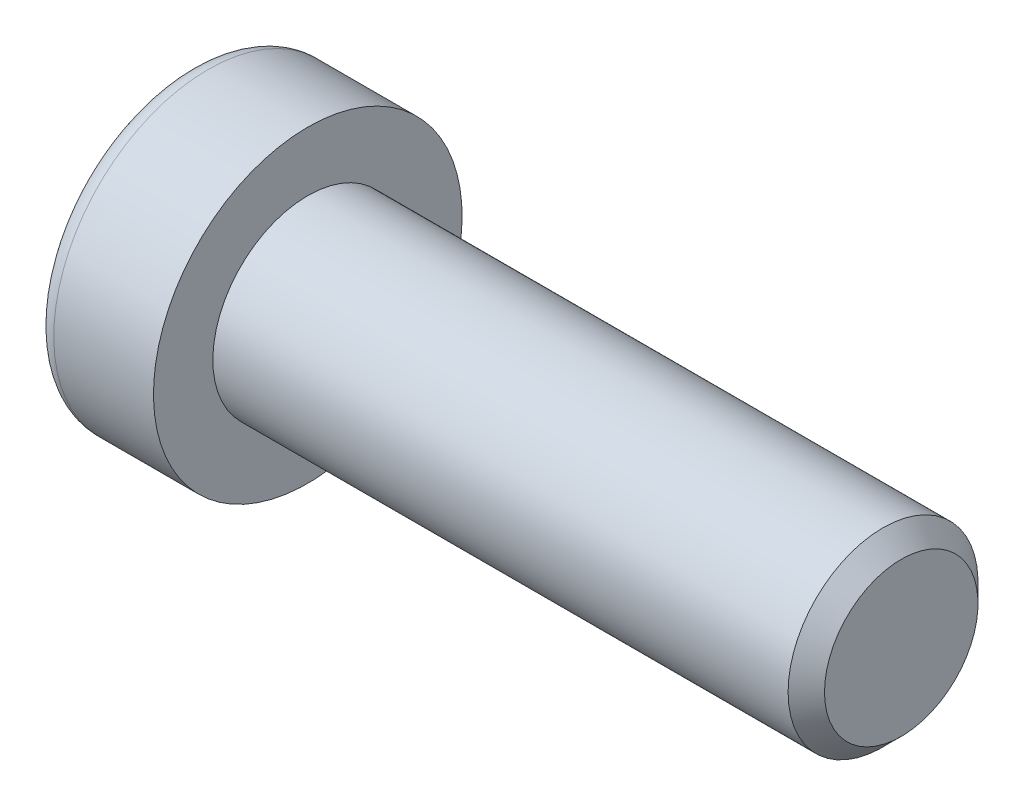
ISO-10303-21;
HEADER;
FILE_DESCRIPTION(('STEP AP214'),'2;1');
FILE_NAME('part.step','',(''),(''),'','','');
FILE_SCHEMA(('AUTOMOTIVE_DESIGN { 1 0 10303 214 1 1 1 1 }'));
ENDSEC;
DATA;
#1=APPLICATION_CONTEXT('core data for automotive mechanical design processes');
#2=APPLICATION_PROTOCOL_DEFINITION('international standard','automotive_design',2000,#1);
#3=PRODUCT_CONTEXT('',#1,'mechanical');
#4=PRODUCT('Part','Part','',(#3));
#5=PRODUCT_RELATED_PRODUCT_CATEGORY('part','',(#4));
#6=PRODUCT_DEFINITION_FORMATION('','',#4);
#7=PRODUCT_DEFINITION_CONTEXT('part definition',#1,'design');
#8=PRODUCT_DEFINITION('design','',#6,#7);
#9=PRODUCT_DEFINITION_SHAPE('','',#8);
#10=(LENGTH_UNIT() NAMED_UNIT(*) SI_UNIT(.MILLI.,.METRE.));
#11=(NAMED_UNIT(*) PLANE_ANGLE_UNIT() SI_UNIT($,.RADIAN.));
#12=(NAMED_UNIT(*) SI_UNIT($,.STERADIAN.) SOLID_ANGLE_UNIT());
#13=UNCERTAINTY_MEASURE_WITH_UNIT(LENGTH_MEASURE(1.E-05),#10,'distance_accuracy_value','');
#14=(GEOMETRIC_REPRESENTATION_CONTEXT(3) GLOBAL_UNCERTAINTY_ASSIGNED_CONTEXT((#13)) GLOBAL_UNIT_ASSIGNED_CONTEXT((#10,
#11,#12)) REPRESENTATION_CONTEXT('',''));
#15=CARTESIAN_POINT('',(0.,0.,0.));
#16=DIRECTION('',(0.,0.,1.));
#17=DIRECTION('',(1.,0.,0.));
#18=AXIS2_PLACEMENT_3D('',#15,#16,#17);
#19=CARTESIAN_POINT('',(-1.21000000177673,0.,0.));
#20=DIRECTION('',(-1.,0.,0.));
#21=DIRECTION('',(0.,0.,1.));
#22=AXIS2_PLACEMENT_3D('',#19,#20,#21);
#23=CONICAL_SURFACE('',#22,2.9040718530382,1.04719754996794);
#24=CARTESIAN_POINT('',(0.466666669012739,-1.13686837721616E-10,0.));
#25=VERTEX_POINT('',#24);
#26=VERTEX_LOOP('',#25);
#27=FACE_BOUND('',#26,.T.);
#28=CARTESIAN_POINT('',(-1.20000000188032,2.50000000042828,1.44337567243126));
#29=CARTESIAN_POINT('',(-1.16336943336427,2.50000000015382,1.31652043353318));
#30=CARTESIAN_POINT('',(-1.13005584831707,2.50000000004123,1.18857018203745));
#31=CARTESIAN_POINT('',(-1.07190798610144,2.49999999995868,0.930454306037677));
#32=CARTESIAN_POINT('',(-1.04709427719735,2.49999999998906,0.800284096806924));
#33=CARTESIAN_POINT('',(-1.00846995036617,2.50000000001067,0.541556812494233));
#34=CARTESIAN_POINT('',(-0.994402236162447,2.50000000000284,0.413039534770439));
#35=CARTESIAN_POINT('',(-0.977611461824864,2.49999999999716,0.155400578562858));
#36=CARTESIAN_POINT('',(-0.974874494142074,2.49999999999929,0.0262798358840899));
#37=CARTESIAN_POINT('',(-0.980582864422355,2.50000000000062,-0.21496841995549));
#38=CARTESIAN_POINT('',(-0.987626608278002,2.50000000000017,-0.327132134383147));
#39=CARTESIAN_POINT('',(-1.00994662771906,2.49999999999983,-0.550728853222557));
#40=CARTESIAN_POINT('',(-1.02523052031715,2.49999999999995,-0.66216108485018));
#41=CARTESIAN_POINT('',(-1.06343729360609,2.50000000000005,-0.886218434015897));
#42=CARTESIAN_POINT('',(-1.08652205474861,2.50000000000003,-0.998815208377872));
#43=CARTESIAN_POINT('',(-1.13891470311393,2.49999999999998,-1.2223298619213));
#44=CARTESIAN_POINT('',(-1.16821028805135,2.49999999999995,-1.33325060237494));
#45=CARTESIAN_POINT('',(-1.20000000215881,2.5,-1.44337567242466));
#46=B_SPLINE_CURVE_WITH_KNOTS('',3,(#28,#29,#30,#31,#32,#33,#34,#35,#36,#37,#38,#39,#40,#41,#42,
#43,#44,#45),.UNSPECIFIED.,.F.,.F.,(4,2,2,2,2,2,2,2,4),(0.,0.396270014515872,0.793492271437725,
1.18088450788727,1.56780111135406,1.90463472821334,2.24178024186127,2.58640202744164,
2.93034746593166),.UNSPECIFIED.);
#47=CARTESIAN_POINT('',(-1.20000000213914,2.49999999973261,1.44337567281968));
#48=VERTEX_POINT('',#47);
#49=CARTESIAN_POINT('',(-1.20000000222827,2.5,-1.44337567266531));
#50=VERTEX_POINT('',#49);
#51=EDGE_CURVE('E20',#48,#50,#46,.T.);
#52=ORIENTED_EDGE('',*,*,#51,.T.);
#53=CARTESIAN_POINT('',(-1.20000000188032,2.49999999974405,-1.44337567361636));
#54=CARTESIAN_POINT('',(-1.16336943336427,2.39014014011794,-1.50680329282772));
#55=CARTESIAN_POINT('',(-1.13005584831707,2.27933197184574,-1.57077841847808));
#56=CARTESIAN_POINT('',(-1.07190798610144,2.05579706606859,-1.69983635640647));
#57=CARTESIAN_POINT('',(-1.04709427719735,1.94306635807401,-1.76492146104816));
#58=CARTESIAN_POINT('',(-1.00846995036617,1.71900195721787,-1.89428510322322));
#59=CARTESIAN_POINT('',(-0.994402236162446,1.60770272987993,-1.95854374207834));
#60=CARTESIAN_POINT('',(-0.977611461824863,1.38458084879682,-2.08736322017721));
#61=CARTESIAN_POINT('',(-0.974874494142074,1.27275900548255,-2.15192359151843));
#62=CARTESIAN_POINT('',(-0.980582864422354,1.06383188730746,-2.27254771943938));
#63=CARTESIAN_POINT('',(-0.987626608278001,0.966695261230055,-2.32862957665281));
#64=CARTESIAN_POINT('',(-1.00994662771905,0.773054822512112,-2.44042793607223));
#65=CARTESIAN_POINT('',(-1.02523052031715,0.676551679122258,-2.49614405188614));
#66=CARTESIAN_POINT('',(-1.06343729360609,0.482512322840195,-2.60817272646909));
#67=CARTESIAN_POINT('',(-1.08652205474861,0.385000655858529,-2.66447111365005));
#68=CARTESIAN_POINT('',(-1.13891470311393,0.191431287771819,-2.77622844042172));
#69=CARTESIAN_POINT('',(-1.16821028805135,0.09537110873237,-2.83168881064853));
#70=CARTESIAN_POINT('',(-1.20000000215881,4.75795613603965E-10,-2.88675134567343));
#71=B_SPLINE_CURVE_WITH_KNOTS('',3,(#53,#54,#55,#56,#57,#58,#59,#60,#61,#62,#63,#64,#65,#66,#67,
#68,#69,#70),.UNSPECIFIED.,.F.,.F.,(4,2,2,2,2,2,2,2,4),(0.,0.396270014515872,0.793492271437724,
1.18088450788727,1.56780111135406,1.90463472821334,2.24178024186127,2.58640202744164,
2.93034746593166),.UNSPECIFIED.);
#72=CARTESIAN_POINT('',(-1.20000000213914,0.,-2.88675134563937));
#73=VERTEX_POINT('',#72);
#74=EDGE_CURVE('E80',#50,#73,#71,.T.);
#75=ORIENTED_EDGE('',*,*,#74,.T.);
#76=CARTESIAN_POINT('',(-1.20000000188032,-6.84219602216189E-10,-2.88675134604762));
#77=CARTESIAN_POINT('',(-1.16336943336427,-0.109859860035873,-2.8233237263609));
#78=CARTESIAN_POINT('',(-1.13005584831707,-0.220668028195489,-2.75934860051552));
#79=CARTESIAN_POINT('',(-1.07190798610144,-0.444202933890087,-2.63029066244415));
#80=CARTESIAN_POINT('',(-1.04709427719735,-0.556933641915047,-2.56520555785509));
#81=CARTESIAN_POINT('',(-1.00846995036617,-0.780998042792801,-2.43584191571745));
#82=CARTESIAN_POINT('',(-0.994402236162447,-0.892297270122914,-2.37158327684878));
#83=CARTESIAN_POINT('',(-0.977611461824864,-1.11541915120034,-2.24276379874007));
#84=CARTESIAN_POINT('',(-0.974874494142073,-1.22724099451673,-2.17820342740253));
#85=CARTESIAN_POINT('',(-0.980582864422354,-1.43616811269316,-2.05757929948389));
#86=CARTESIAN_POINT('',(-0.987626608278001,-1.53330473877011,-2.00149744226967));
#87=CARTESIAN_POINT('',(-1.00994662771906,-1.72694517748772,-1.88969908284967));
#88=CARTESIAN_POINT('',(-1.02523052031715,-1.82344832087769,-1.83398296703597));
#89=CARTESIAN_POINT('',(-1.06343729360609,-2.01748767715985,-1.72195429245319));
#90=CARTESIAN_POINT('',(-1.08652205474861,-2.1149993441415,-1.66565590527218));
#91=CARTESIAN_POINT('',(-1.13891470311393,-2.30856871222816,-1.55389857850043));
#92=CARTESIAN_POINT('',(-1.16821028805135,-2.40462889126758,-1.49843820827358));
#93=CARTESIAN_POINT('',(-1.20000000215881,-2.49999999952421,-1.44337567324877));
#94=B_SPLINE_CURVE_WITH_KNOTS('',3,(#76,#77,#78,#79,#80,#81,#82,#83,#84,#85,#86,#87,#88,#89,#90,
#91,#92,#93),.UNSPECIFIED.,.F.,.F.,(4,2,2,2,2,2,2,2,4),(0.,0.396270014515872,0.793492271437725,
1.18088450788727,1.56780111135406,1.90463472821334,2.24178024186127,2.58640202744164,
2.93034746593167),.UNSPECIFIED.);
#95=CARTESIAN_POINT('',(-1.20000000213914,-2.49999999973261,-1.44337567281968));
#96=VERTEX_POINT('',#95);
#97=EDGE_CURVE('E105',#73,#96,#94,.T.);
#98=ORIENTED_EDGE('',*,*,#97,.T.);
#99=CARTESIAN_POINT('',(-1.20000000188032,-2.50000000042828,-1.44337567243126));
#100=CARTESIAN_POINT('',(-1.16336943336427,-2.50000000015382,-1.31652043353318));
#101=CARTESIAN_POINT('',(-1.13005584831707,-2.50000000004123,-1.18857018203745));
#102=CARTESIAN_POINT('',(-1.07190798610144,-2.49999999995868,-0.93045430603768));
#103=CARTESIAN_POINT('',(-1.04709427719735,-2.49999999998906,-0.800284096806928));
#104=CARTESIAN_POINT('',(-1.00846995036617,-2.50000000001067,-0.541556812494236));
#105=CARTESIAN_POINT('',(-0.994402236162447,-2.50000000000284,-0.413039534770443));
#106=CARTESIAN_POINT('',(-0.977611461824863,-2.49999999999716,-0.155400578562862));
#107=CARTESIAN_POINT('',(-0.974874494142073,-2.49999999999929,-0.0262798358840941));
#108=CARTESIAN_POINT('',(-0.980582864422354,-2.50000000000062,0.214968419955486));
#109=CARTESIAN_POINT('',(-0.987626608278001,-2.50000000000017,0.327132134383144));
#110=CARTESIAN_POINT('',(-1.00994662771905,-2.49999999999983,0.550728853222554));
#111=CARTESIAN_POINT('',(-1.02523052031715,-2.49999999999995,0.662161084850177));
#112=CARTESIAN_POINT('',(-1.06343729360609,-2.50000000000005,0.886218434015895));
#113=CARTESIAN_POINT('',(-1.08652205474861,-2.50000000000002,0.99881520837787));
#114=CARTESIAN_POINT('',(-1.13891470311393,-2.49999999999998,1.2223298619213));
#115=CARTESIAN_POINT('',(-1.16821028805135,-2.49999999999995,1.33325060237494));
#116=CARTESIAN_POINT('',(-1.20000000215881,-2.5,1.44337567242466));
#117=B_SPLINE_CURVE_WITH_KNOTS('',3,(#99,#100,#101,#102,#103,#104,#105,#106,#107,#108,#109,#110,
#111,#112,#113,#114,#115,#116),.UNSPECIFIED.,.F.,.F.,(4,2,2,2,2,2,2,2,4),(0.,0.396270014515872,
0.793492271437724,1.18088450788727,1.56780111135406,1.90463472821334,2.24178024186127,
2.58640202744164,2.93034746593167),.UNSPECIFIED.);
#118=CARTESIAN_POINT('',(-1.20000000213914,-2.49999999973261,1.44337567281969));
#119=VERTEX_POINT('',#118);
#120=EDGE_CURVE('E129',#96,#119,#117,.T.);
#121=ORIENTED_EDGE('',*,*,#120,.T.);
#122=CARTESIAN_POINT('',(-1.20000000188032,-2.49999999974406,1.44337567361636));
#123=CARTESIAN_POINT('',(-1.16336943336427,-2.39014014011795,1.50680329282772));
#124=CARTESIAN_POINT('',(-1.13005584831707,-2.27933197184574,1.57077841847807));
#125=CARTESIAN_POINT('',(-1.07190798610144,-2.05579706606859,1.69983635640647));
#126=CARTESIAN_POINT('',(-1.04709427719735,-1.94306635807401,1.76492146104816));
#127=CARTESIAN_POINT('',(-1.00846995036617,-1.71900195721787,1.89428510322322));
#128=CARTESIAN_POINT('',(-0.994402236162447,-1.60770272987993,1.95854374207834));
#129=CARTESIAN_POINT('',(-0.977611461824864,-1.38458084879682,2.08736322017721));
#130=CARTESIAN_POINT('',(-0.974874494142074,-1.27275900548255,2.15192359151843));
#131=CARTESIAN_POINT('',(-0.980582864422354,-1.06383188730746,2.27254771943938));
#132=CARTESIAN_POINT('',(-0.987626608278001,-0.966695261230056,2.32862957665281));
#133=CARTESIAN_POINT('',(-1.00994662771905,-0.773054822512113,2.44042793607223));
#134=CARTESIAN_POINT('',(-1.02523052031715,-0.676551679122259,2.49614405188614));
#135=CARTESIAN_POINT('',(-1.06343729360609,-0.482512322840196,2.60817272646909));
#136=CARTESIAN_POINT('',(-1.08652205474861,-0.385000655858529,2.66447111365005));
#137=CARTESIAN_POINT('',(-1.13891470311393,-0.19143128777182,2.77622844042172));
#138=CARTESIAN_POINT('',(-1.16821028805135,-0.0953711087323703,2.83168881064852));
#139=CARTESIAN_POINT('',(-1.20000000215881,-4.75795563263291E-10,2.88675134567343));
#140=B_SPLINE_CURVE_WITH_KNOTS('',3,(#122,#123,#124,#125,#126,#127,#128,#129,#130,#131,#132,
#133,#134,#135,#136,#137,#138,#139),.UNSPECIFIED.,.F.,.F.,(4,2,2,2,2,2,2,2,4),(0.,
0.396270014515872,0.793492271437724,1.18088450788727,1.56780111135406,1.90463472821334,
2.24178024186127,2.58640202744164,2.93034746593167),.UNSPECIFIED.);
#141=CARTESIAN_POINT('',(-1.20000000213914,0.,2.88675134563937));
#142=VERTEX_POINT('',#141);
#143=EDGE_CURVE('E137',#119,#142,#140,.T.);
#144=ORIENTED_EDGE('',*,*,#143,.T.);
#145=CARTESIAN_POINT('',(-1.20000000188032,6.84218568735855E-10,2.88675134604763));
#146=CARTESIAN_POINT('',(-1.16336943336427,0.109859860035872,2.8233237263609));
#147=CARTESIAN_POINT('',(-1.13005584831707,0.220668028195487,2.75934860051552));
#148=CARTESIAN_POINT('',(-1.07190798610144,0.444202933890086,2.63029066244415));
#149=CARTESIAN_POINT('',(-1.04709427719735,0.556933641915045,2.56520555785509));
#150=CARTESIAN_POINT('',(-1.00846995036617,0.7809980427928,2.43584191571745));
#151=CARTESIAN_POINT('',(-0.994402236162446,0.892297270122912,2.37158327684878));
#152=CARTESIAN_POINT('',(-0.977611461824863,1.11541915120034,2.24276379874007));
#153=CARTESIAN_POINT('',(-0.974874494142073,1.22724099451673,2.17820342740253));
#154=CARTESIAN_POINT('',(-0.980582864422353,1.43616811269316,2.05757929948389));
#155=CARTESIAN_POINT('',(-0.987626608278,1.53330473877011,2.00149744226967));
#156=CARTESIAN_POINT('',(-1.00994662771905,1.72694517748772,1.88969908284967));
#157=CARTESIAN_POINT('',(-1.02523052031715,1.82344832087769,1.83398296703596));
#158=CARTESIAN_POINT('',(-1.06343729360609,2.01748767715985,1.72195429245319));
#159=CARTESIAN_POINT('',(-1.08652205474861,2.1149993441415,1.66565590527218));
#160=CARTESIAN_POINT('',(-1.13891470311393,2.30856871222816,1.55389857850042));
#161=CARTESIAN_POINT('',(-1.16821028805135,2.40462889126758,1.49843820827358));
#162=CARTESIAN_POINT('',(-1.2000000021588,2.49999999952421,1.44337567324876));
#163=B_SPLINE_CURVE_WITH_KNOTS('',3,(#145,#146,#147,#148,#149,#150,#151,#152,#153,#154,#155,
#156,#157,#158,#159,#160,#161,#162),.UNSPECIFIED.,.F.,.F.,(4,2,2,2,2,2,2,2,4),(0.,
0.396270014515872,0.793492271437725,1.18088450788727,1.56780111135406,1.90463472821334,
2.24178024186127,2.58640202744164,2.93034746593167),.UNSPECIFIED.);
#164=EDGE_CURVE('E82',#142,#48,#163,.T.);
#165=ORIENTED_EDGE('',*,*,#164,.T.);
#166=EDGE_LOOP('',(#52,#75,#98,#121,#144,#165));
#167=FACE_BOUND('',#166,.T.);
#168=ADVANCED_FACE('F16',(#27,#167),#23,.F.);
#169=CARTESIAN_POINT('',(-5.,2.5,1.44337567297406));
#170=DIRECTION('',(0.,1.,0.));
#171=DIRECTION('',(0.,0.,1.));
#172=AXIS2_PLACEMENT_3D('',#169,#170,#171);
#173=PLANE('',#172);
#174=DIRECTION('',(1.,0.,0.));
#175=VECTOR('',#174,1.);
#176=CARTESIAN_POINT('',(-5.,2.5,1.44337567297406));
#177=LINE('',#176,#175);
#178=CARTESIAN_POINT('',(-5.,2.5,1.44337567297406));
#179=VERTEX_POINT('',#178);
#180=EDGE_CURVE('E84',#48,#179,#177,.F.);
#181=ORIENTED_EDGE('',*,*,#180,.T.);
#182=DIRECTION('',(0.,0.,1.));
#183=VECTOR('',#182,1.);
#184=CARTESIAN_POINT('',(-5.,2.5,0.));
#185=LINE('',#184,#183);
#186=CARTESIAN_POINT('',(-5.,2.5,-1.44337567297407));
#187=VERTEX_POINT('',#186);
#188=EDGE_CURVE('E89',#187,#179,#185,.T.);
#189=ORIENTED_EDGE('',*,*,#188,.F.);
#190=DIRECTION('',(1.,0.,0.));
#191=VECTOR('',#190,1.);
#192=CARTESIAN_POINT('',(-5.,2.5,-1.44337567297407));
#193=LINE('',#192,#191);
#194=EDGE_CURVE('E87',#187,#50,#193,.T.);
#195=ORIENTED_EDGE('',*,*,#194,.T.);
#196=ORIENTED_EDGE('',*,*,#51,.F.);
#197=EDGE_LOOP('',(#181,#189,#195,#196));
#198=FACE_BOUND('',#197,.T.);
#199=ADVANCED_FACE('F76',(#198),#173,.F.);
#200=CARTESIAN_POINT('',(-5.,0.,2.88675134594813));
#201=DIRECTION('',(0.,0.500000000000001,0.866025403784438));
#202=DIRECTION('',(0.,-0.866025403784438,0.500000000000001));
#203=AXIS2_PLACEMENT_3D('',#200,#201,#202);
#204=PLANE('',#203);
#205=DIRECTION('',(1.,0.,0.));
#206=VECTOR('',#205,1.);
#207=CARTESIAN_POINT('',(-5.,0.,2.88675134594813));
#208=LINE('',#207,#206);
#209=CARTESIAN_POINT('',(-5.,0.,2.88675134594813));
#210=VERTEX_POINT('',#209);
#211=EDGE_CURVE('E141',#142,#210,#208,.F.);
#212=ORIENTED_EDGE('',*,*,#211,.T.);
#213=DIRECTION('',(0.,-0.866025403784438,0.500000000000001));
#214=VECTOR('',#213,1.);
#215=CARTESIAN_POINT('',(-5.,2.5,1.44337567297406));
#216=LINE('',#215,#214);
#217=EDGE_CURVE('E95',#179,#210,#216,.T.);
#218=ORIENTED_EDGE('',*,*,#217,.F.);
#219=ORIENTED_EDGE('',*,*,#180,.F.);
#220=ORIENTED_EDGE('',*,*,#164,.F.);
#221=EDGE_LOOP('',(#212,#218,#219,#220));
#222=FACE_BOUND('',#221,.T.);
#223=ADVANCED_FACE('F145',(#222),#204,.F.);
#224=CARTESIAN_POINT('',(-5.,-2.5,1.44337567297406));
#225=DIRECTION('',(0.,-0.5,0.866025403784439));
#226=DIRECTION('',(0.,-0.866025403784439,-0.5));
#227=AXIS2_PLACEMENT_3D('',#224,#225,#226);
#228=PLANE('',#227);
#229=DIRECTION('',(1.,0.,0.));
#230=VECTOR('',#229,1.);
#231=CARTESIAN_POINT('',(-5.,-2.5,1.44337567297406));
#232=LINE('',#231,#230);
#233=CARTESIAN_POINT('',(-5.,-2.5,1.44337567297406));
#234=VERTEX_POINT('',#233);
#235=EDGE_CURVE('E136',#119,#234,#232,.F.);
#236=ORIENTED_EDGE('',*,*,#235,.T.);
#237=DIRECTION('',(0.,-0.866025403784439,-0.5));
#238=VECTOR('',#237,1.);
#239=CARTESIAN_POINT('',(-5.,0.,2.88675134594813));
#240=LINE('',#239,#238);
#241=EDGE_CURVE('E224',#210,#234,#240,.T.);
#242=ORIENTED_EDGE('',*,*,#241,.F.);
#243=ORIENTED_EDGE('',*,*,#211,.F.);
#244=ORIENTED_EDGE('',*,*,#143,.F.);
#245=EDGE_LOOP('',(#236,#242,#243,#244));
#246=FACE_BOUND('',#245,.T.);
#247=ADVANCED_FACE('F125',(#246),#228,.F.);
#248=CARTESIAN_POINT('',(-5.,-2.5,-1.44337567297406));
#249=DIRECTION('',(0.,-1.,0.));
#250=DIRECTION('',(0.,0.,-1.));
#251=AXIS2_PLACEMENT_3D('',#248,#249,#250);
#252=PLANE('',#251);
#253=DIRECTION('',(1.,0.,0.));
#254=VECTOR('',#253,1.);
#255=CARTESIAN_POINT('',(-5.,-2.5,-1.44337567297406));
#256=LINE('',#255,#254);
#257=CARTESIAN_POINT('',(-5.,-2.5,-1.44337567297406));
#258=VERTEX_POINT('',#257);
#259=EDGE_CURVE('E135',#96,#258,#256,.F.);
#260=ORIENTED_EDGE('',*,*,#259,.T.);
#261=DIRECTION('',(0.,0.,1.));
#262=VECTOR('',#261,1.);
#263=CARTESIAN_POINT('',(-5.,-2.5,0.));
#264=LINE('',#263,#262);
#265=EDGE_CURVE('E221',#234,#258,#264,.F.);
#266=ORIENTED_EDGE('',*,*,#265,.F.);
#267=ORIENTED_EDGE('',*,*,#235,.F.);
#268=ORIENTED_EDGE('',*,*,#120,.F.);
#269=EDGE_LOOP('',(#260,#266,#267,#268));
#270=FACE_BOUND('',#269,.T.);
#271=ADVANCED_FACE('F121',(#270),#252,.F.);
#272=CARTESIAN_POINT('',(-5.,0.,-2.88675134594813));
#273=DIRECTION('',(0.,-0.5,-0.866025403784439));
#274=DIRECTION('',(0.,0.866025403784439,-0.5));
#275=AXIS2_PLACEMENT_3D('',#272,#273,#274);
#276=PLANE('',#275);
#277=DIRECTION('',(1.,0.,0.));
#278=VECTOR('',#277,1.);
#279=CARTESIAN_POINT('',(-5.,0.,-2.88675134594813));
#280=LINE('',#279,#278);
#281=CARTESIAN_POINT('',(-5.,0.,-2.88675134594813));
#282=VERTEX_POINT('',#281);
#283=EDGE_CURVE('E38',#73,#282,#280,.F.);
#284=ORIENTED_EDGE('',*,*,#283,.T.);
#285=DIRECTION('',(0.,0.866025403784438,-0.500000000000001));
#286=VECTOR('',#285,1.);
#287=CARTESIAN_POINT('',(-5.,-2.5,-1.44337567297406));
#288=LINE('',#287,#286);
#289=EDGE_CURVE('E218',#258,#282,#288,.T.);
#290=ORIENTED_EDGE('',*,*,#289,.F.);
#291=ORIENTED_EDGE('',*,*,#259,.F.);
#292=ORIENTED_EDGE('',*,*,#97,.F.);
#293=EDGE_LOOP('',(#284,#290,#291,#292));
#294=FACE_BOUND('',#293,.T.);
#295=ADVANCED_FACE('F115',(#294),#276,.F.);
#296=CARTESIAN_POINT('',(-5.,2.5,-1.44337567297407));
#297=DIRECTION('',(0.,0.5,-0.866025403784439));
#298=DIRECTION('',(0.,0.866025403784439,0.5));
#299=AXIS2_PLACEMENT_3D('',#296,#297,#298);
#300=PLANE('',#299);
#301=ORIENTED_EDGE('',*,*,#194,.F.);
#302=DIRECTION('',(0.,0.866025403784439,0.5));
#303=VECTOR('',#302,1.);
#304=CARTESIAN_POINT('',(-5.,0.,-2.88675134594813));
#305=LINE('',#304,#303);
#306=EDGE_CURVE('E216',#282,#187,#305,.T.);
#307=ORIENTED_EDGE('',*,*,#306,.F.);
#308=ORIENTED_EDGE('',*,*,#283,.F.);
#309=ORIENTED_EDGE('',*,*,#74,.F.);
#310=EDGE_LOOP('',(#301,#307,#308,#309));
#311=FACE_BOUND('',#310,.T.);
#312=ADVANCED_FACE('F93',(#311),#300,.F.);
#313=CARTESIAN_POINT('',(-5.,4.69337567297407,0.));
#314=DIRECTION('',(-1.,0.,0.));
#315=DIRECTION('',(0.,0.,1.));
#316=AXIS2_PLACEMENT_3D('',#313,#314,#315);
#317=PLANE('',#316);
#318=ORIENTED_EDGE('',*,*,#289,.T.);
#319=ORIENTED_EDGE('',*,*,#306,.T.);
#320=ORIENTED_EDGE('',*,*,#188,.T.);
#321=ORIENTED_EDGE('',*,*,#217,.T.);
#322=ORIENTED_EDGE('',*,*,#241,.T.);
#323=ORIENTED_EDGE('',*,*,#265,.T.);
#324=EDGE_LOOP('',(#318,#319,#320,#321,#322,#323));
#325=FACE_BOUND('',#324,.T.);
#326=CARTESIAN_POINT('',(-5.,0.,0.));
#327=DIRECTION('',(1.,0.,0.));
#328=DIRECTION('',(0.,1.,0.));
#329=AXIS2_PLACEMENT_3D('',#326,#327,#328);
#330=CIRCLE('',#329,5.7);
#331=CARTESIAN_POINT('',(-5.,5.7,0.));
#332=VERTEX_POINT('',#331);
#333=EDGE_CURVE('E193',#332,#332,#330,.T.);
#334=ORIENTED_EDGE('',*,*,#333,.F.);
#335=EDGE_LOOP('',(#334));
#336=FACE_BOUND('',#335,.T.);
#337=ADVANCED_FACE('F114',(#325,#336),#317,.T.);
#338=CARTESIAN_POINT('',(-4.2,0.,0.));
#339=DIRECTION('',(1.,0.,0.));
#340=DIRECTION('',(0.,0.,-1.));
#341=AXIS2_PLACEMENT_3D('',#338,#339,#340);
#342=TOROIDAL_SURFACE('',#341,5.7,0.8);
#343=CARTESIAN_POINT('',(-4.2,0.,0.));
#344=DIRECTION('',(1.,0.,0.));
#345=DIRECTION('',(0.,1.,0.));
#346=AXIS2_PLACEMENT_3D('',#343,#344,#345);
#347=CIRCLE('',#346,6.5);
#348=CARTESIAN_POINT('',(-4.2,6.5,0.));
#349=VERTEX_POINT('',#348);
#350=EDGE_CURVE('E234',#349,#349,#347,.T.);
#351=ORIENTED_EDGE('',*,*,#350,.F.);
#352=EDGE_LOOP('',(#351));
#353=FACE_BOUND('',#352,.T.);
#354=ORIENTED_EDGE('',*,*,#333,.T.);
#355=EDGE_LOOP('',(#354));
#356=FACE_BOUND('',#355,.T.);
#357=ADVANCED_FACE('F177',(#353,#356),#342,.T.);
#358=CARTESIAN_POINT('',(-2.5,0.,0.));
#359=DIRECTION('',(1.,0.,0.));
#360=DIRECTION('',(0.,1.,0.));
#361=AXIS2_PLACEMENT_3D('',#358,#359,#360);
#362=CYLINDRICAL_SURFACE('',#361,6.5);
#363=ORIENTED_EDGE('',*,*,#350,.T.);
#364=EDGE_LOOP('',(#363));
#365=FACE_BOUND('',#364,.T.);
#366=CARTESIAN_POINT('',(0.,0.,0.));
#367=DIRECTION('',(1.,0.,0.));
#368=DIRECTION('',(0.,1.,0.));
#369=AXIS2_PLACEMENT_3D('',#366,#367,#368);
#370=CIRCLE('',#369,6.5);
#371=CARTESIAN_POINT('',(0.,6.5,0.));
#372=VERTEX_POINT('',#371);
#373=EDGE_CURVE('E103',#372,#372,#370,.T.);
#374=ORIENTED_EDGE('',*,*,#373,.F.);
#375=EDGE_LOOP('',(#374));
#376=FACE_BOUND('',#375,.T.);
#377=ADVANCED_FACE('F174',(#365,#376),#362,.T.);
#378=CARTESIAN_POINT('',(25.,2.,0.));
#379=DIRECTION('',(1.,0.,0.));
#380=DIRECTION('',(0.,0.,-1.));
#381=AXIS2_PLACEMENT_3D('',#378,#379,#380);
#382=PLANE('',#381);
#383=CARTESIAN_POINT('',(25.0000000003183,0.,0.));
#384=DIRECTION('',(-1.,0.,0.));
#385=DIRECTION('',(0.,0.,1.));
#386=AXIS2_PLACEMENT_3D('',#383,#384,#385);
#387=CIRCLE('',#386,3.2331875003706);
#388=CARTESIAN_POINT('',(25.0000000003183,0.,3.2331875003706));
#389=VERTEX_POINT('',#388);
#390=EDGE_CURVE('E230',#389,#389,#387,.T.);
#391=ORIENTED_EDGE('',*,*,#390,.F.);
#392=EDGE_LOOP('',(#391));
#393=FACE_BOUND('',#392,.T.);
#394=ADVANCED_FACE('F170',(#393),#382,.T.);
#395=CARTESIAN_POINT('',(0.,5.25,0.));
#396=DIRECTION('',(1.,0.,0.));
#397=DIRECTION('',(0.,0.,-1.));
#398=AXIS2_PLACEMENT_3D('',#395,#396,#397);
#399=PLANE('',#398);
#400=CARTESIAN_POINT('',(0.,0.,0.));
#401=DIRECTION('',(1.,0.,0.));
#402=DIRECTION('',(0.,1.,0.));
#403=AXIS2_PLACEMENT_3D('',#400,#401,#402);
#404=CIRCLE('',#403,4.);
#405=CARTESIAN_POINT('',(0.,4.,0.));
#406=VERTEX_POINT('',#405);
#407=EDGE_CURVE('E29',#406,#406,#404,.T.);
#408=ORIENTED_EDGE('',*,*,#407,.F.);
#409=EDGE_LOOP('',(#408));
#410=FACE_BOUND('',#409,.T.);
#411=ORIENTED_EDGE('',*,*,#373,.T.);
#412=EDGE_LOOP('',(#411));
#413=FACE_BOUND('',#412,.T.);
#414=ADVANCED_FACE('F163',(#410,#413),#399,.T.);
#415=CARTESIAN_POINT('',(24.2331874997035,0.,0.));
#416=DIRECTION('',(-1.,0.,0.));
#417=DIRECTION('',(0.,0.,1.));
#418=AXIS2_PLACEMENT_3D('',#415,#416,#417);
#419=CONICAL_SURFACE('',#418,3.99999999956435,0.78539816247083);
#420=ORIENTED_EDGE('',*,*,#390,.T.);
#421=EDGE_LOOP('',(#420));
#422=FACE_BOUND('',#421,.T.);
#423=CARTESIAN_POINT('',(24.2331875,0.,0.));
#424=DIRECTION('',(1.,0.,0.));
#425=DIRECTION('',(0.,1.,0.));
#426=AXIS2_PLACEMENT_3D('',#423,#424,#425);
#427=CIRCLE('',#426,4.);
#428=CARTESIAN_POINT('',(24.2331875,4.,0.));
#429=VERTEX_POINT('',#428);
#430=EDGE_CURVE('E11',#429,#429,#427,.F.);
#431=ORIENTED_EDGE('',*,*,#430,.F.);
#432=EDGE_LOOP('',(#431));
#433=FACE_BOUND('',#432,.T.);
#434=ADVANCED_FACE('F156',(#422,#433),#419,.T.);
#435=CARTESIAN_POINT('',(13.,0.,0.));
#436=DIRECTION('',(1.,0.,0.));
#437=DIRECTION('',(0.,1.,0.));
#438=AXIS2_PLACEMENT_3D('',#435,#436,#437);
#439=CYLINDRICAL_SURFACE('',#438,4.);
#440=ORIENTED_EDGE('',*,*,#430,.T.);
#441=EDGE_LOOP('',(#440));
#442=FACE_BOUND('',#441,.T.);
#443=ORIENTED_EDGE('',*,*,#407,.T.);
#444=EDGE_LOOP('',(#443));
#445=FACE_BOUND('',#444,.T.);
#446=ADVANCED_FACE('F154',(#442,#445),#439,.T.);
#447=CLOSED_SHELL('',(#168,#199,#223,#247,#271,#295,#312,#337,#357,#377,#394,#414,#434,#446));
#448=MANIFOLD_SOLID_BREP('B1',#447);
#449=ADVANCED_BREP_SHAPE_REPRESENTATION('',(#18,#448),#14);
#450=SHAPE_DEFINITION_REPRESENTATION(#9,#449);
ENDSEC;
END-ISO-10303-21;
